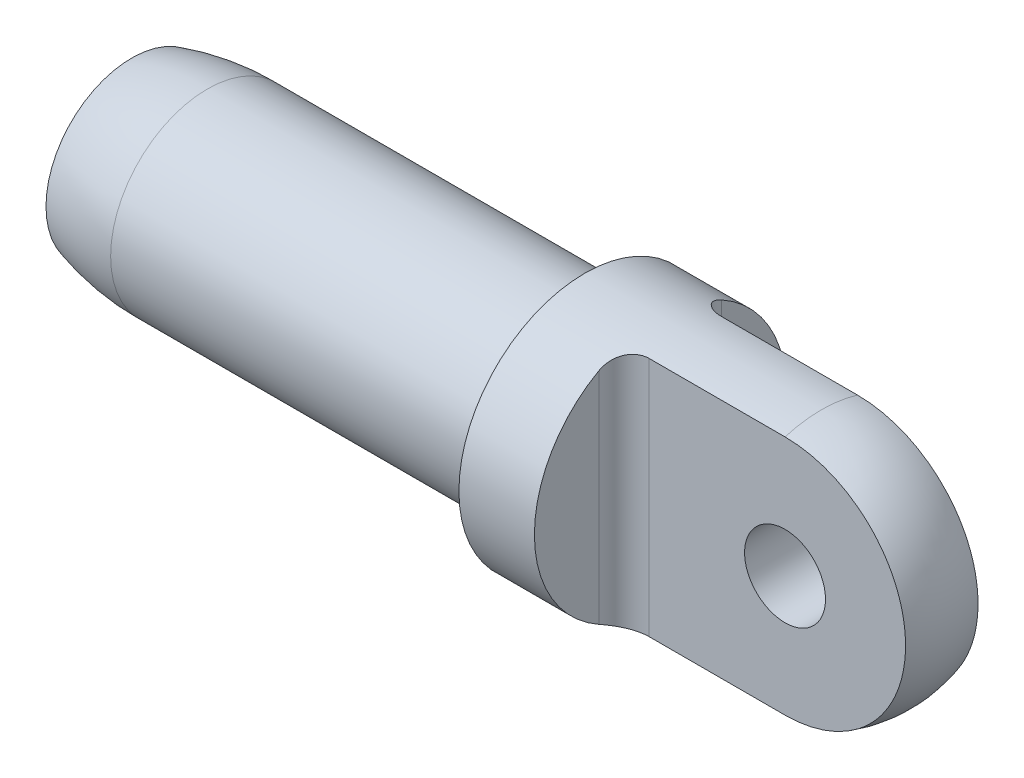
ISO-10303-21;
HEADER;
FILE_DESCRIPTION(('STEP AP214'),'2;1');
FILE_NAME('part.step','',(''),(''),'','','');
FILE_SCHEMA(('AUTOMOTIVE_DESIGN { 1 0 10303 214 1 1 1 1 }'));
ENDSEC;
DATA;
#1=APPLICATION_CONTEXT('core data for automotive mechanical design processes');
#2=APPLICATION_PROTOCOL_DEFINITION('international standard','automotive_design',2000,#1);
#3=PRODUCT_CONTEXT('',#1,'mechanical');
#4=PRODUCT('Part','Part','',(#3));
#5=PRODUCT_RELATED_PRODUCT_CATEGORY('part','',(#4));
#6=PRODUCT_DEFINITION_FORMATION('','',#4);
#7=PRODUCT_DEFINITION_CONTEXT('part definition',#1,'design');
#8=PRODUCT_DEFINITION('design','',#6,#7);
#9=PRODUCT_DEFINITION_SHAPE('','',#8);
#10=(LENGTH_UNIT() NAMED_UNIT(*) SI_UNIT(.MILLI.,.METRE.));
#11=(NAMED_UNIT(*) PLANE_ANGLE_UNIT() SI_UNIT($,.RADIAN.));
#12=(NAMED_UNIT(*) SI_UNIT($,.STERADIAN.) SOLID_ANGLE_UNIT());
#13=UNCERTAINTY_MEASURE_WITH_UNIT(LENGTH_MEASURE(1.E-05),#10,'distance_accuracy_value','');
#14=(GEOMETRIC_REPRESENTATION_CONTEXT(3) GLOBAL_UNCERTAINTY_ASSIGNED_CONTEXT((#13)) GLOBAL_UNIT_ASSIGNED_CONTEXT((#10,
#11,#12)) REPRESENTATION_CONTEXT('',''));
#15=CARTESIAN_POINT('',(0.,0.,0.));
#16=DIRECTION('',(0.,0.,1.));
#17=DIRECTION('',(1.,0.,0.));
#18=AXIS2_PLACEMENT_3D('',#15,#16,#17);
#19=CARTESIAN_POINT('',(-57.15,0.,0.));
#20=DIRECTION('',(-1.,0.,0.));
#21=DIRECTION('',(0.,0.,1.));
#22=AXIS2_PLACEMENT_3D('',#19,#20,#21);
#23=CYLINDRICAL_SURFACE('',#22,7.9375);
#24=CARTESIAN_POINT('',(-13.6525,0.,0.));
#25=DIRECTION('',(-1.,0.,0.));
#26=DIRECTION('',(0.,0.,1.));
#27=AXIS2_PLACEMENT_3D('',#24,#25,#26);
#28=CIRCLE('',#27,7.93749999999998);
#29=CARTESIAN_POINT('',(-13.6525,-7.60119137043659,-2.286));
#30=VERTEX_POINT('',#29);
#31=CARTESIAN_POINT('',(-13.6525,-7.60119137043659,2.286));
#32=VERTEX_POINT('',#31);
#33=EDGE_CURVE('E90',#30,#32,#28,.T.);
#34=ORIENTED_EDGE('',*,*,#33,.T.);
#35=DIRECTION('',(-1.,0.,0.));
#36=VECTOR('',#35,1.);
#37=CARTESIAN_POINT('',(-57.15,-7.60119137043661,2.28599999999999));
#38=LINE('',#37,#36);
#39=CARTESIAN_POINT('',(-22.225,-7.60119137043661,2.286));
#40=VERTEX_POINT('',#39);
#41=EDGE_CURVE('E33',#32,#40,#38,.T.);
#42=ORIENTED_EDGE('',*,*,#41,.T.);
#43=CARTESIAN_POINT('',(-22.225,-5.76032857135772,5.46099999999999));
#44=CARTESIAN_POINT('',(-22.151545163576,-5.76032942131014,5.46099932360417));
#45=CARTESIAN_POINT('',(-22.0780860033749,-5.76521273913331,5.45586188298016));
#46=CARTESIAN_POINT('',(-21.9337456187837,-5.78417009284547,5.43575788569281));
#47=CARTESIAN_POINT('',(-21.8628664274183,-5.7982512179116,5.4207837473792));
#48=CARTESIAN_POINT('',(-21.7261938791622,-5.83402519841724,5.3822607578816));
#49=CARTESIAN_POINT('',(-21.6603661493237,-5.85565975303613,5.35877753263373));
#50=CARTESIAN_POINT('',(-21.5342269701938,-5.90488821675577,5.30448352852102));
#51=CARTESIAN_POINT('',(-21.4739193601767,-5.93248622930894,5.27366770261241));
#52=CARTESIAN_POINT('',(-21.3350653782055,-6.00468447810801,5.19150922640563));
#53=CARTESIAN_POINT('',(-21.259569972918,-6.05154336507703,5.13699338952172));
#54=CARTESIAN_POINT('',(-21.1210289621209,-6.15061608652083,5.01795268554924));
#55=CARTESIAN_POINT('',(-21.0580025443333,-6.20283798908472,4.95341266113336));
#56=CARTESIAN_POINT('',(-20.943498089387,-6.31102593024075,4.81484395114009));
#57=CARTESIAN_POINT('',(-20.8922554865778,-6.36704339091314,4.74066170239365));
#58=CARTESIAN_POINT('',(-20.8031699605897,-6.47986686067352,4.58524425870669));
#59=CARTESIAN_POINT('',(-20.7653263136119,-6.53667282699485,4.50400944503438));
#60=CARTESIAN_POINT('',(-20.6985106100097,-6.65886587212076,4.32172899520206));
#61=CARTESIAN_POINT('',(-20.6720708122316,-6.7241040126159,4.21963890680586));
#62=CARTESIAN_POINT('',(-20.6398396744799,-6.85114269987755,4.01008172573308));
#63=CARTESIAN_POINT('',(-20.6340540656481,-6.91294228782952,3.90261314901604));
#64=CARTESIAN_POINT('',(-20.644729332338,-7.02897838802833,3.68938863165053));
#65=CARTESIAN_POINT('',(-20.6604370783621,-7.08340113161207,3.58369957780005));
#66=CARTESIAN_POINT('',(-20.7140715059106,-7.1853433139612,3.37464483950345));
#67=CARTESIAN_POINT('',(-20.7519727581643,-7.23287057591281,3.27127663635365));
#68=CARTESIAN_POINT('',(-20.8438669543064,-7.31414852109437,3.08482614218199));
#69=CARTESIAN_POINT('',(-20.8951642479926,-7.34888483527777,3.00084444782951));
#70=CARTESIAN_POINT('',(-21.0139481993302,-7.41163094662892,2.84233952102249));
#71=CARTESIAN_POINT('',(-21.0814228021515,-7.43964572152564,2.76780930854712));
#72=CARTESIAN_POINT('',(-21.2223501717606,-7.48608336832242,2.63943521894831));
#73=CARTESIAN_POINT('',(-21.2943184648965,-7.50522407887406,2.58421553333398));
#74=CARTESIAN_POINT('',(-21.4474959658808,-7.53817653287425,2.48645730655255));
#75=CARTESIAN_POINT('',(-21.5287019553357,-7.55199012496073,2.44391436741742));
#76=CARTESIAN_POINT('',(-21.6932487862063,-7.573875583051,2.37519496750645));
#77=CARTESIAN_POINT('',(-21.7762376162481,-7.58221719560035,2.3482588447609));
#78=CARTESIAN_POINT('',(-21.9458156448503,-7.59447289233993,2.30831747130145));
#79=CARTESIAN_POINT('',(-22.0324043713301,-7.59838755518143,2.29531039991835));
#80=CARTESIAN_POINT('',(-22.2050561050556,-7.60185163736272,2.28381107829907));
#81=CARTESIAN_POINT('',(-22.2911006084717,-7.60147821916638,2.28506225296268));
#82=CARTESIAN_POINT('',(-22.461738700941,-7.59654352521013,2.30141352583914));
#83=CARTESIAN_POINT('',(-22.5463323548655,-7.59198243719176,2.31651300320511));
#84=CARTESIAN_POINT('',(-22.7114547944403,-7.57858703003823,2.35996505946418));
#85=CARTESIAN_POINT('',(-22.7919933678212,-7.56976360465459,2.38828384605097));
#86=CARTESIAN_POINT('',(-22.9470010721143,-7.54769152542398,2.45714445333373));
#87=CARTESIAN_POINT('',(-23.0214703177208,-7.53444295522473,2.49768604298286));
#88=CARTESIAN_POINT('',(-23.1629641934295,-7.50323849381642,2.58992259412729));
#89=CARTESIAN_POINT('',(-23.229920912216,-7.48524393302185,2.64170853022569));
#90=CARTESIAN_POINT('',(-23.3540254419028,-7.44452878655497,2.75435592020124));
#91=CARTESIAN_POINT('',(-23.4111726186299,-7.42180789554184,2.81521796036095));
#92=CARTESIAN_POINT('',(-23.5159966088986,-7.37098435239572,2.94576510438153));
#93=CARTESIAN_POINT('',(-23.5633528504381,-7.34274541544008,3.01565400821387));
#94=CARTESIAN_POINT('',(-23.6457867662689,-7.28160406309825,3.16043110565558));
#95=CARTESIAN_POINT('',(-23.6808614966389,-7.24870053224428,3.235320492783));
#96=CARTESIAN_POINT('',(-23.7404762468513,-7.17638746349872,3.39283838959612));
#97=CARTESIAN_POINT('',(-23.7641766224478,-7.13669307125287,3.47565263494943));
#98=CARTESIAN_POINT('',(-23.7978250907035,-7.0532526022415,3.64200616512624));
#99=CARTESIAN_POINT('',(-23.8077679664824,-7.00950499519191,3.72554571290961));
#100=CARTESIAN_POINT('',(-23.8149328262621,-6.91392656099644,3.90031683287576));
#101=CARTESIAN_POINT('',(-23.8106717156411,-6.86173240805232,3.99140941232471));
#102=CARTESIAN_POINT('',(-23.7871632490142,-6.75467428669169,4.17003002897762));
#103=CARTESIAN_POINT('',(-23.7679061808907,-6.69980860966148,4.25755571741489));
#104=CARTESIAN_POINT('',(-23.7121417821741,-6.58194394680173,4.43789291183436));
#105=CARTESIAN_POINT('',(-23.6738030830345,-6.51877502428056,4.53002919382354));
#106=CARTESIAN_POINT('',(-23.5804268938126,-6.3929708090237,4.70590305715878));
#107=CARTESIAN_POINT('',(-23.5253829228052,-6.33033573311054,4.78963736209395));
#108=CARTESIAN_POINT('',(-23.4062410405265,-6.21525742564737,4.93784122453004));
#109=CARTESIAN_POINT('',(-23.3438630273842,-6.16246119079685,5.00341839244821));
#110=CARTESIAN_POINT('',(-23.2064808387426,-6.06206977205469,5.12458574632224));
#111=CARTESIAN_POINT('',(-23.1314956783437,-6.01446693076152,5.18019071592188));
#112=CARTESIAN_POINT('',(-22.9891928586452,-5.93861553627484,5.26680369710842));
#113=CARTESIAN_POINT('',(-22.9245194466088,-5.9084855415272,5.30049826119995));
#114=CARTESIAN_POINT('',(-22.7887373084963,-5.85513686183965,5.35937101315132));
#115=CARTESIAN_POINT('',(-22.7176363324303,-5.83190999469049,5.38455928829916));
#116=CARTESIAN_POINT('',(-22.5770937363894,-5.79615946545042,5.42301352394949));
#117=CARTESIAN_POINT('',(-22.5080989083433,-5.78284902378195,5.43716164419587));
#118=CARTESIAN_POINT('',(-22.3677362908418,-5.76493619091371,5.45615197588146));
#119=CARTESIAN_POINT('',(-22.2963701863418,-5.76032774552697,5.46100065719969));
#120=CARTESIAN_POINT('',(-22.225,-5.76032857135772,5.46099999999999));
#121=B_SPLINE_CURVE_WITH_KNOTS('',3,(#43,#44,#45,#46,#47,#48,#49,#50,#51,#52,#53,#54,#55,#56,
#57,#58,#59,#60,#61,#62,#63,#64,#65,#66,#67,#68,#69,#70,#71,#72,#73,#74,#75,#76,#77,#78,#79,#80,
#81,#82,#83,#84,#85,#86,#87,#88,#89,#90,#91,#92,#93,#94,#95,#96,#97,#98,#99,#100,#101,#102,#103,
#104,#105,#106,#107,#108,#109,#110,#111,#112,#113,#114,#115,#116,#117,#118,#119,#120),
.UNSPECIFIED.,.T.,.F.,(4,2,2,2,2,2,2,2,2,2,2,2,2,2,2,2,2,2,2,2,2,2,2,2,2,2,2,2,2,2,2,2,2,2,2,2,
2,2,4),(0.,0.220051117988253,0.44027204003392,0.65882946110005,0.877537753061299,
1.1885938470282,1.50012494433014,1.81742427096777,2.13470645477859,2.5049051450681,
2.87520655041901,3.23285946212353,3.59010337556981,3.9014133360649,4.21249203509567,
4.48919646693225,4.76580478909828,5.02747796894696,5.28911694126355,5.54605530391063,
5.802982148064,6.05925578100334,6.3155245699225,6.57394961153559,6.83239135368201,
7.09828483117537,7.36424200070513,7.64760426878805,7.93107395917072,8.24502992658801,
8.55918939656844,8.91201374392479,9.26497514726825,9.57815139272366,9.89085945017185,
10.1267200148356,10.3622998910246,10.5762548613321,10.7900609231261),.UNSPECIFIED.);
#122=CARTESIAN_POINT('',(-23.8125,-6.92819630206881,3.87350000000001));
#123=VERTEX_POINT('',#122);
#124=EDGE_CURVE('E10',#40,#123,#121,.T.);
#125=ORIENTED_EDGE('',*,*,#124,.T.);
#126=CARTESIAN_POINT('',(-23.8125,0.,0.));
#127=DIRECTION('',(-1.,0.,0.));
#128=DIRECTION('',(0.,0.,1.));
#129=AXIS2_PLACEMENT_3D('',#126,#127,#128);
#130=CIRCLE('',#129,7.9375);
#131=CARTESIAN_POINT('',(-23.8125,6.92819630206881,3.87350000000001));
#132=VERTEX_POINT('',#131);
#133=EDGE_CURVE('E331',#123,#132,#130,.T.);
#134=ORIENTED_EDGE('',*,*,#133,.T.);
#135=CARTESIAN_POINT('',(-22.225,5.76032857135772,5.46099999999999));
#136=CARTESIAN_POINT('',(-22.298454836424,5.76032942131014,5.46099932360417));
#137=CARTESIAN_POINT('',(-22.3719139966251,5.7652127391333,5.45586188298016));
#138=CARTESIAN_POINT('',(-22.5162543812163,5.78417009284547,5.43575788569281));
#139=CARTESIAN_POINT('',(-22.5871335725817,5.7982512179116,5.4207837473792));
#140=CARTESIAN_POINT('',(-22.7238061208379,5.83402519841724,5.3822607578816));
#141=CARTESIAN_POINT('',(-22.7896338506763,5.85565975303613,5.35877753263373));
#142=CARTESIAN_POINT('',(-22.9157730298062,5.90488821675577,5.30448352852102));
#143=CARTESIAN_POINT('',(-22.9760806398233,5.93248622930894,5.27366770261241));
#144=CARTESIAN_POINT('',(-23.1149346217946,6.00468447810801,5.19150922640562));
#145=CARTESIAN_POINT('',(-23.190430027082,6.05154336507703,5.13699338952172));
#146=CARTESIAN_POINT('',(-23.3289710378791,6.15061608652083,5.01795268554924));
#147=CARTESIAN_POINT('',(-23.3919974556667,6.20283798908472,4.95341266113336));
#148=CARTESIAN_POINT('',(-23.506501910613,6.31102593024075,4.81484395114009));
#149=CARTESIAN_POINT('',(-23.5577445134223,6.36704339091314,4.74066170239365));
#150=CARTESIAN_POINT('',(-23.6468300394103,6.47986686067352,4.58524425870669));
#151=CARTESIAN_POINT('',(-23.6846736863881,6.53667282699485,4.50400944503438));
#152=CARTESIAN_POINT('',(-23.7514893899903,6.65886587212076,4.32172899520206));
#153=CARTESIAN_POINT('',(-23.7779291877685,6.7241040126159,4.21963890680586));
#154=CARTESIAN_POINT('',(-23.8101603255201,6.85114269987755,4.01008172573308));
#155=CARTESIAN_POINT('',(-23.8159459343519,6.91294228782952,3.90261314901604));
#156=CARTESIAN_POINT('',(-23.8052706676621,7.02897838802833,3.68938863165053));
#157=CARTESIAN_POINT('',(-23.789562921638,7.08340113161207,3.58369957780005));
#158=CARTESIAN_POINT('',(-23.7359284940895,7.1853433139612,3.37464483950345));
#159=CARTESIAN_POINT('',(-23.6980272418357,7.23287057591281,3.27127663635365));
#160=CARTESIAN_POINT('',(-23.6061330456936,7.31414852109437,3.08482614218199));
#161=CARTESIAN_POINT('',(-23.5548357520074,7.34888483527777,3.00084444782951));
#162=CARTESIAN_POINT('',(-23.4360518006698,7.41163094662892,2.84233952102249));
#163=CARTESIAN_POINT('',(-23.3685771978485,7.43964572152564,2.76780930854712));
#164=CARTESIAN_POINT('',(-23.2276498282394,7.48608336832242,2.63943521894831));
#165=CARTESIAN_POINT('',(-23.1556815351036,7.50522407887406,2.58421553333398));
#166=CARTESIAN_POINT('',(-23.0025040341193,7.53817653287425,2.48645730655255));
#167=CARTESIAN_POINT('',(-22.9212980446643,7.55199012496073,2.44391436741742));
#168=CARTESIAN_POINT('',(-22.7567512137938,7.573875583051,2.37519496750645));
#169=CARTESIAN_POINT('',(-22.673762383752,7.58221719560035,2.3482588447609));
#170=CARTESIAN_POINT('',(-22.5041843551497,7.59447289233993,2.30831747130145));
#171=CARTESIAN_POINT('',(-22.4175956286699,7.59838755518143,2.29531039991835));
#172=CARTESIAN_POINT('',(-22.2449438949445,7.60185163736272,2.28381107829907));
#173=CARTESIAN_POINT('',(-22.1588993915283,7.60147821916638,2.28506225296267));
#174=CARTESIAN_POINT('',(-21.988261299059,7.59654352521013,2.30141352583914));
#175=CARTESIAN_POINT('',(-21.9036676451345,7.59198243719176,2.31651300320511));
#176=CARTESIAN_POINT('',(-21.7385452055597,7.57858703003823,2.35996505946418));
#177=CARTESIAN_POINT('',(-21.6580066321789,7.56976360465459,2.38828384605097));
#178=CARTESIAN_POINT('',(-21.5029989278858,7.54769152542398,2.45714445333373));
#179=CARTESIAN_POINT('',(-21.4285296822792,7.53444295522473,2.49768604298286));
#180=CARTESIAN_POINT('',(-21.2870358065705,7.50323849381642,2.58992259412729));
#181=CARTESIAN_POINT('',(-21.220079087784,7.48524393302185,2.64170853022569));
#182=CARTESIAN_POINT('',(-21.0959745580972,7.44452878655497,2.75435592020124));
#183=CARTESIAN_POINT('',(-21.0388273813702,7.42180789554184,2.81521796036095));
#184=CARTESIAN_POINT('',(-20.9340033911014,7.37098435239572,2.94576510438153));
#185=CARTESIAN_POINT('',(-20.886647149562,7.34274541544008,3.01565400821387));
#186=CARTESIAN_POINT('',(-20.8042132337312,7.28160406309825,3.16043110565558));
#187=CARTESIAN_POINT('',(-20.7691385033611,7.24870053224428,3.235320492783));
#188=CARTESIAN_POINT('',(-20.7095237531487,7.17638746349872,3.39283838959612));
#189=CARTESIAN_POINT('',(-20.6858233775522,7.13669307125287,3.47565263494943));
#190=CARTESIAN_POINT('',(-20.6521749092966,7.0532526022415,3.64200616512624));
#191=CARTESIAN_POINT('',(-20.6422320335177,7.00950499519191,3.72554571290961));
#192=CARTESIAN_POINT('',(-20.635067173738,6.91392656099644,3.90031683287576));
#193=CARTESIAN_POINT('',(-20.6393282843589,6.86173240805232,3.99140941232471));
#194=CARTESIAN_POINT('',(-20.6628367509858,6.75467428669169,4.17003002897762));
#195=CARTESIAN_POINT('',(-20.6820938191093,6.69980860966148,4.25755571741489));
#196=CARTESIAN_POINT('',(-20.7378582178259,6.58194394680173,4.43789291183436));
#197=CARTESIAN_POINT('',(-20.7761969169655,6.51877502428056,4.53002919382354));
#198=CARTESIAN_POINT('',(-20.8695731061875,6.3929708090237,4.70590305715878));
#199=CARTESIAN_POINT('',(-20.9246170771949,6.33033573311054,4.78963736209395));
#200=CARTESIAN_POINT('',(-21.0437589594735,6.21525742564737,4.93784122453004));
#201=CARTESIAN_POINT('',(-21.1061369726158,6.16246119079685,5.00341839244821));
#202=CARTESIAN_POINT('',(-21.2435191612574,6.06206977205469,5.12458574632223));
#203=CARTESIAN_POINT('',(-21.3185043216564,6.01446693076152,5.18019071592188));
#204=CARTESIAN_POINT('',(-21.4608071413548,5.93861553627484,5.26680369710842));
#205=CARTESIAN_POINT('',(-21.5254805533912,5.9084855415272,5.30049826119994));
#206=CARTESIAN_POINT('',(-21.6612626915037,5.85513686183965,5.35937101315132));
#207=CARTESIAN_POINT('',(-21.7323636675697,5.83190999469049,5.38455928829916));
#208=CARTESIAN_POINT('',(-21.8729062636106,5.79615946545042,5.42301352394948));
#209=CARTESIAN_POINT('',(-21.9419010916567,5.78284902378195,5.43716164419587));
#210=CARTESIAN_POINT('',(-22.0822637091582,5.76493619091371,5.45615197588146));
#211=CARTESIAN_POINT('',(-22.1536298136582,5.76032774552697,5.46100065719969));
#212=CARTESIAN_POINT('',(-22.225,5.76032857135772,5.46099999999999));
#213=B_SPLINE_CURVE_WITH_KNOTS('',3,(#135,#136,#137,#138,#139,#140,#141,#142,#143,#144,#145,
#146,#147,#148,#149,#150,#151,#152,#153,#154,#155,#156,#157,#158,#159,#160,#161,#162,#163,#164,
#165,#166,#167,#168,#169,#170,#171,#172,#173,#174,#175,#176,#177,#178,#179,#180,#181,#182,#183,
#184,#185,#186,#187,#188,#189,#190,#191,#192,#193,#194,#195,#196,#197,#198,#199,#200,#201,#202,
#203,#204,#205,#206,#207,#208,#209,#210,#211,#212),.UNSPECIFIED.,.T.,.F.,(4,2,2,2,2,2,2,2,2,2,2,
2,2,2,2,2,2,2,2,2,2,2,2,2,2,2,2,2,2,2,2,2,2,2,2,2,2,2,4),(0.,0.220051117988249,0.44027204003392,
0.65882946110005,0.877537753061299,1.1885938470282,1.50012494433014,1.81742427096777,
2.13470645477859,2.5049051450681,2.87520655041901,3.23285946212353,3.59010337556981,
3.9014133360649,4.21249203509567,4.48919646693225,4.76580478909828,5.02747796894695,
5.28911694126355,5.54605530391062,5.802982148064,6.05925578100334,6.3155245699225,
6.57394961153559,6.83239135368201,7.09828483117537,7.36424200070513,7.64760426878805,
7.93107395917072,8.24502992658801,8.55918939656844,8.91201374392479,9.26497514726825,
9.57815139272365,9.89085945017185,10.1267200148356,10.3622998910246,10.5762548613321,
10.7900609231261),.UNSPECIFIED.);
#214=CARTESIAN_POINT('',(-22.225,7.60119137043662,2.286));
#215=VERTEX_POINT('',#214);
#216=EDGE_CURVE('E26',#132,#215,#213,.T.);
#217=ORIENTED_EDGE('',*,*,#216,.T.);
#218=DIRECTION('',(-1.,0.,0.));
#219=VECTOR('',#218,1.);
#220=CARTESIAN_POINT('',(-57.15,7.60119137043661,2.28599999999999));
#221=LINE('',#220,#219);
#222=CARTESIAN_POINT('',(-13.6525,7.60119137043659,2.286));
#223=VERTEX_POINT('',#222);
#224=EDGE_CURVE('E84',#215,#223,#221,.F.);
#225=ORIENTED_EDGE('',*,*,#224,.T.);
#226=CARTESIAN_POINT('',(-13.6525,7.60119137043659,-2.286));
#227=VERTEX_POINT('',#226);
#228=EDGE_CURVE('E41',#223,#227,#28,.T.);
#229=ORIENTED_EDGE('',*,*,#228,.T.);
#230=DIRECTION('',(-1.,0.,0.));
#231=VECTOR('',#230,1.);
#232=CARTESIAN_POINT('',(-57.15,7.60119137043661,-2.286));
#233=LINE('',#232,#231);
#234=CARTESIAN_POINT('',(-22.225,7.60119137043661,-2.286));
#235=VERTEX_POINT('',#234);
#236=EDGE_CURVE('E103',#227,#235,#233,.T.);
#237=ORIENTED_EDGE('',*,*,#236,.T.);
#238=CARTESIAN_POINT('',(-22.225,7.60119137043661,-2.286));
#239=CARTESIAN_POINT('',(-22.3108637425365,7.60119146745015,-2.28600136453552));
#240=CARTESIAN_POINT('',(-22.3967431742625,7.59910012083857,-2.29298898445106));
#241=CARTESIAN_POINT('',(-22.5660612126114,7.59068350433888,-2.32069700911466));
#242=CARTESIAN_POINT('',(-22.6494990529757,7.58435691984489,-2.34142167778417));
#243=CARTESIAN_POINT('',(-22.8115105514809,7.56733980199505,-2.39584667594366));
#244=CARTESIAN_POINT('',(-22.8900865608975,7.55665139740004,-2.42954067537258));
#245=CARTESIAN_POINT('',(-23.0402453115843,7.53074744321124,-2.50867977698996));
#246=CARTESIAN_POINT('',(-23.1118286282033,7.51553226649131,-2.55412391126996));
#247=CARTESIAN_POINT('',(-23.2467289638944,7.48029857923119,-2.65554808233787));
#248=CARTESIAN_POINT('',(-23.3099714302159,7.46024076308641,-2.71161348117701));
#249=CARTESIAN_POINT('',(-23.4260198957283,7.41537233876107,-2.83200986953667));
#250=CARTESIAN_POINT('',(-23.4788249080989,7.39056128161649,-2.8963416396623));
#251=CARTESIAN_POINT('',(-23.5747169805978,7.3353703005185,-3.03346188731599));
#252=CARTESIAN_POINT('',(-23.6173958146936,7.3048248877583,-3.10646854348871));
#253=CARTESIAN_POINT('',(-23.6901044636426,7.23915041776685,-3.25658161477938));
#254=CARTESIAN_POINT('',(-23.7201306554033,7.20402005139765,-3.33368919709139));
#255=CARTESIAN_POINT('',(-23.7693581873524,7.12693591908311,-3.49561282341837));
#256=CARTESIAN_POINT('',(-23.7875843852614,7.08466858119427,-3.58057467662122));
#257=CARTESIAN_POINT('',(-23.8100314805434,6.99629491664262,-3.75032513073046));
#258=CARTESIAN_POINT('',(-23.8142470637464,6.95018714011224,-3.83511365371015));
#259=CARTESIAN_POINT('',(-23.8091809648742,6.84962204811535,-4.01224323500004));
#260=CARTESIAN_POINT('',(-23.7982994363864,6.79481306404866,-4.10433816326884));
#261=CARTESIAN_POINT('',(-23.7612454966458,6.68297888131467,-4.28403172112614));
#262=CARTESIAN_POINT('',(-23.735060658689,6.62595191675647,-4.3716266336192));
#263=CARTESIAN_POINT('',(-23.6643928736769,6.50444419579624,-4.55073101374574));
#264=CARTESIAN_POINT('',(-23.6181116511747,6.43987977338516,-4.64147760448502));
#265=CARTESIAN_POINT('',(-23.508430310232,6.31243201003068,-4.81337137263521));
#266=CARTESIAN_POINT('',(-23.4450313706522,6.24954855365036,-4.89451921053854));
#267=CARTESIAN_POINT('',(-23.3150401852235,6.14021517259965,-5.03068612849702));
#268=CARTESIAN_POINT('',(-23.251309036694,6.09290365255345,-5.08774604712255));
#269=CARTESIAN_POINT('',(-23.1129189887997,6.00404393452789,-5.19230668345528));
#270=CARTESIAN_POINT('',(-23.0382784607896,5.96248627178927,-5.23982315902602));
#271=CARTESIAN_POINT('',(-22.8968317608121,5.89681284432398,-5.31350815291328));
#272=CARTESIAN_POINT('',(-22.8321256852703,5.87088102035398,-5.34207383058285));
#273=CARTESIAN_POINT('',(-22.6972752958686,5.82616010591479,-5.39081272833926));
#274=CARTESIAN_POINT('',(-22.6271356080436,5.80736501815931,-5.41099299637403));
#275=CARTESIAN_POINT('',(-22.4823399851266,5.77854554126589,-5.44176249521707));
#276=CARTESIAN_POINT('',(-22.4076512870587,5.76859554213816,-5.45227040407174));
#277=CARTESIAN_POINT('',(-22.2568935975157,5.75893719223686,-5.46247256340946));
#278=CARTESIAN_POINT('',(-22.1808255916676,5.75922179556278,-5.46217425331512));
#279=CARTESIAN_POINT('',(-22.0399599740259,5.7692706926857,-5.45155522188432));
#280=CARTESIAN_POINT('',(-21.9749683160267,5.77781429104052,-5.44252503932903));
#281=CARTESIAN_POINT('',(-21.8478334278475,5.80183645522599,-5.41690927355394));
#282=CARTESIAN_POINT('',(-21.7856915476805,5.8173182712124,-5.40032014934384));
#283=CARTESIAN_POINT('',(-21.6482952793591,5.85930367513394,-5.35478002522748));
#284=CARTESIAN_POINT('',(-21.5743404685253,5.88768988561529,-5.3236547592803));
#285=CARTESIAN_POINT('',(-21.4342388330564,5.95144041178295,-5.25229053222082));
#286=CARTESIAN_POINT('',(-21.3681072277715,5.98681798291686,-5.21203423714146));
#287=CARTESIAN_POINT('',(-21.2253323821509,6.07375231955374,-5.11068652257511));
#288=CARTESIAN_POINT('',(-21.1515623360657,6.12696575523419,-5.04697636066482));
#289=CARTESIAN_POINT('',(-21.018239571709,6.23775401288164,-4.90939497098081));
#290=CARTESIAN_POINT('',(-20.9586979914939,6.29533220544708,-4.83551585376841));
#291=CARTESIAN_POINT('',(-20.8532218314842,6.41314964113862,-4.67816463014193));
#292=CARTESIAN_POINT('',(-20.8075176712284,6.47341658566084,-4.59455913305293));
#293=CARTESIAN_POINT('',(-20.7316354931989,6.59360385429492,-4.42035084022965));
#294=CARTESIAN_POINT('',(-20.7014583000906,6.65352415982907,-4.32974767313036));
#295=CARTESIAN_POINT('',(-20.6553223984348,6.77750747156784,-4.1332982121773));
#296=CARTESIAN_POINT('',(-20.6412169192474,6.84133342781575,-4.02685551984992));
#297=CARTESIAN_POINT('',(-20.6350692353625,6.96414983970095,-3.8105073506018));
#298=CARTESIAN_POINT('',(-20.6430219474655,7.02314140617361,-3.70060267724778));
#299=CARTESIAN_POINT('',(-20.6811158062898,7.13003135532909,-3.48990574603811));
#300=CARTESIAN_POINT('',(-20.7095145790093,7.178432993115,-3.38905905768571));
#301=CARTESIAN_POINT('',(-20.7871860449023,7.26805230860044,-3.19233042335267));
#302=CARTESIAN_POINT('',(-20.8364348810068,7.30927812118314,-3.09644294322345));
#303=CARTESIAN_POINT('',(-20.9472833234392,7.37873855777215,-2.92667482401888));
#304=CARTESIAN_POINT('',(-21.0063769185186,7.40797114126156,-2.85156236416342));
#305=CARTESIAN_POINT('',(-21.1384598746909,7.46014883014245,-2.71212647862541));
#306=CARTESIAN_POINT('',(-21.2114420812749,7.4830971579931,-2.64779752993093));
#307=CARTESIAN_POINT('',(-21.3617128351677,7.52089946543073,-2.53831261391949));
#308=CARTESIAN_POINT('',(-21.4379734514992,7.53630692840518,-2.49193146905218));
#309=CARTESIAN_POINT('',(-21.5978563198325,7.56214096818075,-2.41240295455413));
#310=CARTESIAN_POINT('',(-21.6814739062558,7.57257067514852,-2.37924727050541));
#311=CARTESIAN_POINT('',(-21.8413593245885,7.58751142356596,-2.33111908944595));
#312=CARTESIAN_POINT('',(-21.9170029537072,7.59264929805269,-2.31424295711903));
#313=CARTESIAN_POINT('',(-22.0700935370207,7.59948912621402,-2.29168312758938));
#314=CARTESIAN_POINT('',(-22.1475403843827,7.60119128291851,-2.28599876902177));
#315=CARTESIAN_POINT('',(-22.225,7.60119137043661,-2.286));
#316=B_SPLINE_CURVE_WITH_KNOTS('',3,(#238,#239,#240,#241,#242,#243,#244,#245,#246,#247,#248,
#249,#250,#251,#252,#253,#254,#255,#256,#257,#258,#259,#260,#261,#262,#263,#264,#265,#266,#267,
#268,#269,#270,#271,#272,#273,#274,#275,#276,#277,#278,#279,#280,#281,#282,#283,#284,#285,#286,
#287,#288,#289,#290,#291,#292,#293,#294,#295,#296,#297,#298,#299,#300,#301,#302,#303,#304,#305,
#306,#307,#308,#309,#310,#311,#312,#313,#314,#315),.UNSPECIFIED.,.T.,.F.,(4,2,2,2,2,2,2,2,2,2,2,
2,2,2,2,2,2,2,2,2,2,2,2,2,2,2,2,2,2,2,2,2,2,2,2,2,2,2,4),(0.,0.257311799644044,
0.514703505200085,0.771969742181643,1.02921479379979,1.28862246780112,1.54805465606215,
1.81663288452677,2.08528796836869,2.37399363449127,2.6628087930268,2.9846761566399,
3.30680524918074,3.66704389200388,4.02725773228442,4.31948553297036,4.61122677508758,
4.83638184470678,5.06134728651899,5.28818733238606,5.51487121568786,5.71247710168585,
5.91017565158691,6.16412216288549,6.41855485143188,6.74996643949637,7.08163661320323,
7.41855927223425,7.75549982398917,8.1282704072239,8.50095509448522,8.84515460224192,
9.18896132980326,9.48714724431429,9.78517996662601,10.0555587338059,10.3257672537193,
10.557907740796,10.7900345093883),.UNSPECIFIED.);
#317=CARTESIAN_POINT('',(-23.8125,6.92819630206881,-3.87350000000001));
#318=VERTEX_POINT('',#317);
#319=EDGE_CURVE('E129',#235,#318,#316,.T.);
#320=ORIENTED_EDGE('',*,*,#319,.T.);
#321=CARTESIAN_POINT('',(-23.8125,0.,0.));
#322=DIRECTION('',(-1.,0.,0.));
#323=DIRECTION('',(0.,0.,1.));
#324=AXIS2_PLACEMENT_3D('',#321,#322,#323);
#325=CIRCLE('',#324,7.9375);
#326=CARTESIAN_POINT('',(-23.8125,-6.92819630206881,-3.87350000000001));
#327=VERTEX_POINT('',#326);
#328=EDGE_CURVE('E126',#318,#327,#325,.T.);
#329=ORIENTED_EDGE('',*,*,#328,.T.);
#330=CARTESIAN_POINT('',(-22.225,-7.60119137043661,-2.286));
#331=CARTESIAN_POINT('',(-22.1391362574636,-7.60119146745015,-2.28600136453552));
#332=CARTESIAN_POINT('',(-22.0532568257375,-7.59910012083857,-2.29298898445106));
#333=CARTESIAN_POINT('',(-21.8839387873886,-7.59068350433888,-2.32069700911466));
#334=CARTESIAN_POINT('',(-21.8005009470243,-7.58435691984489,-2.34142167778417));
#335=CARTESIAN_POINT('',(-21.6384894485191,-7.56733980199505,-2.39584667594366));
#336=CARTESIAN_POINT('',(-21.5599134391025,-7.55665139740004,-2.42954067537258));
#337=CARTESIAN_POINT('',(-21.4097546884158,-7.53074744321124,-2.50867977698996));
#338=CARTESIAN_POINT('',(-21.3381713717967,-7.51553226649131,-2.55412391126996));
#339=CARTESIAN_POINT('',(-21.2032710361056,-7.48029857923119,-2.65554808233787));
#340=CARTESIAN_POINT('',(-21.1400285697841,-7.46024076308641,-2.71161348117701));
#341=CARTESIAN_POINT('',(-21.0239801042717,-7.41537233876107,-2.83200986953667));
#342=CARTESIAN_POINT('',(-20.9711750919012,-7.39056128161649,-2.8963416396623));
#343=CARTESIAN_POINT('',(-20.8752830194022,-7.3353703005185,-3.03346188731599));
#344=CARTESIAN_POINT('',(-20.8326041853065,-7.3048248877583,-3.10646854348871));
#345=CARTESIAN_POINT('',(-20.7598955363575,-7.23915041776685,-3.25658161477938));
#346=CARTESIAN_POINT('',(-20.7298693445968,-7.20402005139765,-3.33368919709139));
#347=CARTESIAN_POINT('',(-20.6806418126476,-7.12693591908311,-3.49561282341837));
#348=CARTESIAN_POINT('',(-20.6624156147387,-7.08466858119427,-3.58057467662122));
#349=CARTESIAN_POINT('',(-20.6399685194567,-6.99629491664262,-3.75032513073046));
#350=CARTESIAN_POINT('',(-20.6357529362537,-6.95018714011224,-3.83511365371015));
#351=CARTESIAN_POINT('',(-20.6408190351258,-6.84962204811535,-4.01224323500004));
#352=CARTESIAN_POINT('',(-20.6517005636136,-6.79481306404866,-4.10433816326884));
#353=CARTESIAN_POINT('',(-20.6887545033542,-6.68297888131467,-4.28403172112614));
#354=CARTESIAN_POINT('',(-20.7149393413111,-6.62595191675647,-4.3716266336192));
#355=CARTESIAN_POINT('',(-20.7856071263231,-6.50444419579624,-4.55073101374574));
#356=CARTESIAN_POINT('',(-20.8318883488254,-6.43987977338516,-4.64147760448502));
#357=CARTESIAN_POINT('',(-20.9415696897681,-6.31243201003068,-4.81337137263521));
#358=CARTESIAN_POINT('',(-21.0049686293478,-6.24954855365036,-4.89451921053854));
#359=CARTESIAN_POINT('',(-21.1349598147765,-6.14021517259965,-5.03068612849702));
#360=CARTESIAN_POINT('',(-21.198690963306,-6.09290365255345,-5.08774604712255));
#361=CARTESIAN_POINT('',(-21.3370810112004,-6.00404393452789,-5.19230668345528));
#362=CARTESIAN_POINT('',(-21.4117215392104,-5.96248627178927,-5.23982315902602));
#363=CARTESIAN_POINT('',(-21.553168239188,-5.89681284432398,-5.31350815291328));
#364=CARTESIAN_POINT('',(-21.6178743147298,-5.87088102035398,-5.34207383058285));
#365=CARTESIAN_POINT('',(-21.7527247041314,-5.82616010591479,-5.39081272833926));
#366=CARTESIAN_POINT('',(-21.8228643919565,-5.80736501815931,-5.41099299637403));
#367=CARTESIAN_POINT('',(-21.9676600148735,-5.77854554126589,-5.44176249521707));
#368=CARTESIAN_POINT('',(-22.0423487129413,-5.76859554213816,-5.45227040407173));
#369=CARTESIAN_POINT('',(-22.1931064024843,-5.75893719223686,-5.46247256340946));
#370=CARTESIAN_POINT('',(-22.2691744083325,-5.75922179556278,-5.46217425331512));
#371=CARTESIAN_POINT('',(-22.4100400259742,-5.7692706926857,-5.45155522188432));
#372=CARTESIAN_POINT('',(-22.4750316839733,-5.77781429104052,-5.44252503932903));
#373=CARTESIAN_POINT('',(-22.6021665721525,-5.80183645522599,-5.41690927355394));
#374=CARTESIAN_POINT('',(-22.6643084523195,-5.8173182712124,-5.40032014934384));
#375=CARTESIAN_POINT('',(-22.801704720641,-5.85930367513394,-5.35478002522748));
#376=CARTESIAN_POINT('',(-22.8756595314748,-5.88768988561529,-5.3236547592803));
#377=CARTESIAN_POINT('',(-23.0157611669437,-5.95144041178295,-5.25229053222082));
#378=CARTESIAN_POINT('',(-23.0818927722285,-5.98681798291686,-5.21203423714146));
#379=CARTESIAN_POINT('',(-23.2246676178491,-6.07375231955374,-5.11068652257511));
#380=CARTESIAN_POINT('',(-23.2984376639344,-6.12696575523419,-5.04697636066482));
#381=CARTESIAN_POINT('',(-23.431760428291,-6.23775401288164,-4.90939497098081));
#382=CARTESIAN_POINT('',(-23.4913020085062,-6.29533220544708,-4.83551585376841));
#383=CARTESIAN_POINT('',(-23.5967781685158,-6.41314964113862,-4.67816463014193));
#384=CARTESIAN_POINT('',(-23.6424823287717,-6.47341658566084,-4.59455913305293));
#385=CARTESIAN_POINT('',(-23.7183645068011,-6.59360385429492,-4.42035084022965));
#386=CARTESIAN_POINT('',(-23.7485416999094,-6.65352415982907,-4.32974767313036));
#387=CARTESIAN_POINT('',(-23.7946776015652,-6.77750747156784,-4.1332982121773));
#388=CARTESIAN_POINT('',(-23.8087830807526,-6.84133342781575,-4.02685551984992));
#389=CARTESIAN_POINT('',(-23.8149307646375,-6.96414983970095,-3.8105073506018));
#390=CARTESIAN_POINT('',(-23.8069780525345,-7.02314140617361,-3.70060267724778));
#391=CARTESIAN_POINT('',(-23.7688841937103,-7.13003135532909,-3.48990574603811));
#392=CARTESIAN_POINT('',(-23.7404854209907,-7.178432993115,-3.38905905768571));
#393=CARTESIAN_POINT('',(-23.6628139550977,-7.26805230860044,-3.19233042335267));
#394=CARTESIAN_POINT('',(-23.6135651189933,-7.30927812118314,-3.09644294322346));
#395=CARTESIAN_POINT('',(-23.5027166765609,-7.37873855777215,-2.92667482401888));
#396=CARTESIAN_POINT('',(-23.4436230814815,-7.40797114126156,-2.85156236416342));
#397=CARTESIAN_POINT('',(-23.3115401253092,-7.46014883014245,-2.71212647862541));
#398=CARTESIAN_POINT('',(-23.2385579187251,-7.4830971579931,-2.64779752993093));
#399=CARTESIAN_POINT('',(-23.0882871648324,-7.52089946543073,-2.53831261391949));
#400=CARTESIAN_POINT('',(-23.0120265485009,-7.53630692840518,-2.49193146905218));
#401=CARTESIAN_POINT('',(-22.8521436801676,-7.56214096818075,-2.41240295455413));
#402=CARTESIAN_POINT('',(-22.7685260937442,-7.57257067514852,-2.37924727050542));
#403=CARTESIAN_POINT('',(-22.6086406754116,-7.58751142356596,-2.33111908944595));
#404=CARTESIAN_POINT('',(-22.5329970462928,-7.59264929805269,-2.31424295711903));
#405=CARTESIAN_POINT('',(-22.3799064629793,-7.59948912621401,-2.29168312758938));
#406=CARTESIAN_POINT('',(-22.3024596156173,-7.60119128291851,-2.28599876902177));
#407=CARTESIAN_POINT('',(-22.225,-7.60119137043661,-2.286));
#408=B_SPLINE_CURVE_WITH_KNOTS('',3,(#330,#331,#332,#333,#334,#335,#336,#337,#338,#339,#340,
#341,#342,#343,#344,#345,#346,#347,#348,#349,#350,#351,#352,#353,#354,#355,#356,#357,#358,#359,
#360,#361,#362,#363,#364,#365,#366,#367,#368,#369,#370,#371,#372,#373,#374,#375,#376,#377,#378,
#379,#380,#381,#382,#383,#384,#385,#386,#387,#388,#389,#390,#391,#392,#393,#394,#395,#396,#397,
#398,#399,#400,#401,#402,#403,#404,#405,#406,#407),.UNSPECIFIED.,.T.,.F.,(4,2,2,2,2,2,2,2,2,2,2,
2,2,2,2,2,2,2,2,2,2,2,2,2,2,2,2,2,2,2,2,2,2,2,2,2,2,2,4),(0.,0.257311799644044,
0.514703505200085,0.771969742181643,1.02921479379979,1.28862246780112,1.54805465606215,
1.81663288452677,2.08528796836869,2.37399363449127,2.6628087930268,2.98467615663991,
3.30680524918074,3.66704389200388,4.02725773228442,4.31948553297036,4.61122677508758,
4.83638184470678,5.06134728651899,5.28818733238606,5.51487121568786,5.71247710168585,
5.91017565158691,6.16412216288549,6.41855485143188,6.74996643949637,7.08163661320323,
7.41855927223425,7.75549982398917,8.1282704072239,8.50095509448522,8.84515460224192,
9.18896132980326,9.48714724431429,9.785179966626,10.0555587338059,10.3257672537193,
10.557907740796,10.7900345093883),.UNSPECIFIED.);
#409=CARTESIAN_POINT('',(-22.225,-7.60119137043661,-2.286));
#410=VERTEX_POINT('',#409);
#411=EDGE_CURVE('E135',#327,#410,#408,.T.);
#412=ORIENTED_EDGE('',*,*,#411,.T.);
#413=DIRECTION('',(-1.,0.,0.));
#414=VECTOR('',#413,1.);
#415=CARTESIAN_POINT('',(-57.15,-7.60119137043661,-2.286));
#416=LINE('',#415,#414);
#417=EDGE_CURVE('E100',#410,#30,#416,.F.);
#418=ORIENTED_EDGE('',*,*,#417,.T.);
#419=EDGE_LOOP('',(#34,#42,#125,#134,#217,#225,#229,#237,#320,#329,#412,#418));
#420=FACE_BOUND('',#419,.T.);
#421=CARTESIAN_POINT('',(-28.575,0.,0.));
#422=DIRECTION('',(-1.,0.,0.));
#423=DIRECTION('',(0.,0.,1.));
#424=AXIS2_PLACEMENT_3D('',#421,#422,#423);
#425=CIRCLE('',#424,7.93750000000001);
#426=CARTESIAN_POINT('',(-28.575,0.,7.93750000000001));
#427=VERTEX_POINT('',#426);
#428=EDGE_CURVE('E115',#427,#427,#425,.T.);
#429=ORIENTED_EDGE('',*,*,#428,.F.);
#430=EDGE_LOOP('',(#429));
#431=FACE_BOUND('',#430,.T.);
#432=ADVANCED_FACE('F15',(#420,#431),#23,.T.);
#433=CARTESIAN_POINT('',(-57.15,0.,0.));
#434=DIRECTION('',(-1.,0.,0.));
#435=DIRECTION('',(0.,0.,1.));
#436=AXIS2_PLACEMENT_3D('',#433,#434,#435);
#437=CYLINDRICAL_SURFACE('',#436,6.096);
#438=CARTESIAN_POINT('',(-52.3875,0.,0.));
#439=DIRECTION('',(-1.,0.,0.));
#440=DIRECTION('',(0.,0.,1.));
#441=AXIS2_PLACEMENT_3D('',#438,#439,#440);
#442=CIRCLE('',#441,6.096);
#443=CARTESIAN_POINT('',(-52.3875,0.,6.096));
#444=VERTEX_POINT('',#443);
#445=EDGE_CURVE('E121',#444,#444,#442,.T.);
#446=ORIENTED_EDGE('',*,*,#445,.F.);
#447=EDGE_LOOP('',(#446));
#448=FACE_BOUND('',#447,.T.);
#449=CARTESIAN_POINT('',(-28.575,0.,0.));
#450=DIRECTION('',(-1.,0.,0.));
#451=DIRECTION('',(0.,0.,1.));
#452=AXIS2_PLACEMENT_3D('',#449,#450,#451);
#453=CIRCLE('',#452,6.096);
#454=CARTESIAN_POINT('',(-28.575,0.,6.096));
#455=VERTEX_POINT('',#454);
#456=EDGE_CURVE('E118',#455,#455,#453,.T.);
#457=ORIENTED_EDGE('',*,*,#456,.T.);
#458=EDGE_LOOP('',(#457));
#459=FACE_BOUND('',#458,.T.);
#460=ADVANCED_FACE('F169',(#448,#459),#437,.T.);
#461=CARTESIAN_POINT('',(-28.575,0.,-6.096));
#462=DIRECTION('',(-1.,0.,0.));
#463=DIRECTION('',(0.,0.,1.));
#464=AXIS2_PLACEMENT_3D('',#461,#462,#463);
#465=PLANE('',#464);
#466=ORIENTED_EDGE('',*,*,#428,.T.);
#467=EDGE_LOOP('',(#466));
#468=FACE_BOUND('',#467,.T.);
#469=ORIENTED_EDGE('',*,*,#456,.F.);
#470=EDGE_LOOP('',(#469));
#471=FACE_BOUND('',#470,.T.);
#472=ADVANCED_FACE('F156',(#468,#471),#465,.T.);
#473=CARTESIAN_POINT('',(-13.6525,0.,0.));
#474=DIRECTION('',(-1.,0.,0.));
#475=DIRECTION('',(0.,0.,-1.));
#476=AXIS2_PLACEMENT_3D('',#473,#474,#475);
#477=SPHERICAL_SURFACE('',#476,7.93749999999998);
#478=ORIENTED_EDGE('',*,*,#228,.F.);
#479=CARTESIAN_POINT('',(-13.6525,0.,2.286));
#480=DIRECTION('',(0.,0.,-1.));
#481=DIRECTION('',(-1.,0.,0.));
#482=AXIS2_PLACEMENT_3D('',#479,#480,#481);
#483=CIRCLE('',#482,7.60119137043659);
#484=EDGE_CURVE('E332',#32,#223,#483,.F.);
#485=ORIENTED_EDGE('',*,*,#484,.F.);
#486=ORIENTED_EDGE('',*,*,#33,.F.);
#487=CARTESIAN_POINT('',(-13.6525,0.,-2.286));
#488=DIRECTION('',(0.,0.,1.));
#489=DIRECTION('',(1.,0.,0.));
#490=AXIS2_PLACEMENT_3D('',#487,#488,#489);
#491=CIRCLE('',#490,7.60119137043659);
#492=EDGE_CURVE('E124',#227,#30,#491,.F.);
#493=ORIENTED_EDGE('',*,*,#492,.F.);
#494=EDGE_LOOP('',(#478,#485,#486,#493));
#495=FACE_BOUND('',#494,.T.);
#496=ADVANCED_FACE('F147',(#495),#477,.T.);
#497=CARTESIAN_POINT('',(-22.225,-63.5,-3.8735));
#498=DIRECTION('',(0.,1.,0.));
#499=DIRECTION('',(0.,0.,1.));
#500=AXIS2_PLACEMENT_3D('',#497,#498,#499);
#501=CYLINDRICAL_SURFACE('',#500,1.5875);
#502=DIRECTION('',(0.,1.,0.));
#503=VECTOR('',#502,1.);
#504=CARTESIAN_POINT('',(-23.8125,-63.5,-3.87350000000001));
#505=LINE('',#504,#503);
#506=EDGE_CURVE('E91',#327,#318,#505,.T.);
#507=ORIENTED_EDGE('',*,*,#506,.T.);
#508=ORIENTED_EDGE('',*,*,#319,.F.);
#509=DIRECTION('',(0.,1.,0.));
#510=VECTOR('',#509,1.);
#511=CARTESIAN_POINT('',(-22.225,-63.5,-2.286));
#512=LINE('',#511,#510);
#513=EDGE_CURVE('E94',#410,#235,#512,.T.);
#514=ORIENTED_EDGE('',*,*,#513,.F.);
#515=ORIENTED_EDGE('',*,*,#411,.F.);
#516=EDGE_LOOP('',(#507,#508,#514,#515));
#517=FACE_BOUND('',#516,.T.);
#518=ADVANCED_FACE('F141',(#517),#501,.F.);
#519=CARTESIAN_POINT('',(-23.8125,-63.5,-7.9375));
#520=DIRECTION('',(-1.,0.,0.));
#521=DIRECTION('',(0.,0.,1.));
#522=AXIS2_PLACEMENT_3D('',#519,#520,#521);
#523=PLANE('',#522);
#524=ORIENTED_EDGE('',*,*,#506,.F.);
#525=ORIENTED_EDGE('',*,*,#328,.F.);
#526=EDGE_LOOP('',(#524,#525));
#527=FACE_BOUND('',#526,.T.);
#528=ADVANCED_FACE('F146',(#527),#523,.F.);
#529=CARTESIAN_POINT('',(-22.225,-63.5,-2.286));
#530=DIRECTION('',(0.,0.,1.));
#531=DIRECTION('',(1.,0.,0.));
#532=AXIS2_PLACEMENT_3D('',#529,#530,#531);
#533=PLANE('',#532);
#534=CARTESIAN_POINT('',(-13.6525,0.,-2.286));
#535=DIRECTION('',(0.,0.,1.));
#536=DIRECTION('',(1.,0.,0.));
#537=AXIS2_PLACEMENT_3D('',#534,#535,#536);
#538=CIRCLE('',#537,2.55269999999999);
#539=CARTESIAN_POINT('',(-11.0998,0.,-2.286));
#540=VERTEX_POINT('',#539);
#541=EDGE_CURVE('E338',#540,#540,#538,.T.);
#542=ORIENTED_EDGE('',*,*,#541,.T.);
#543=EDGE_LOOP('',(#542));
#544=FACE_BOUND('',#543,.T.);
#545=ORIENTED_EDGE('',*,*,#492,.T.);
#546=ORIENTED_EDGE('',*,*,#417,.F.);
#547=ORIENTED_EDGE('',*,*,#513,.T.);
#548=ORIENTED_EDGE('',*,*,#236,.F.);
#549=EDGE_LOOP('',(#545,#546,#547,#548));
#550=FACE_BOUND('',#549,.T.);
#551=ADVANCED_FACE('F149',(#544,#550),#533,.F.);
#552=CARTESIAN_POINT('',(-22.225,-63.5,3.8735));
#553=DIRECTION('',(0.,1.,0.));
#554=DIRECTION('',(0.,0.,1.));
#555=AXIS2_PLACEMENT_3D('',#552,#553,#554);
#556=CYLINDRICAL_SURFACE('',#555,1.5875);
#557=DIRECTION('',(0.,1.,0.));
#558=VECTOR('',#557,1.);
#559=CARTESIAN_POINT('',(-22.225,-63.5,2.286));
#560=LINE('',#559,#558);
#561=EDGE_CURVE('E79',#40,#215,#560,.T.);
#562=ORIENTED_EDGE('',*,*,#561,.T.);
#563=ORIENTED_EDGE('',*,*,#216,.F.);
#564=DIRECTION('',(0.,1.,0.));
#565=VECTOR('',#564,1.);
#566=CARTESIAN_POINT('',(-23.8125,-63.5,3.87350000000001));
#567=LINE('',#566,#565);
#568=EDGE_CURVE('E82',#123,#132,#567,.T.);
#569=ORIENTED_EDGE('',*,*,#568,.F.);
#570=ORIENTED_EDGE('',*,*,#124,.F.);
#571=EDGE_LOOP('',(#562,#563,#569,#570));
#572=FACE_BOUND('',#571,.T.);
#573=ADVANCED_FACE('F77',(#572),#556,.F.);
#574=CARTESIAN_POINT('',(-23.8125,-63.5,7.9375));
#575=DIRECTION('',(-1.,0.,0.));
#576=DIRECTION('',(0.,0.,1.));
#577=AXIS2_PLACEMENT_3D('',#574,#575,#576);
#578=PLANE('',#577);
#579=ORIENTED_EDGE('',*,*,#133,.F.);
#580=ORIENTED_EDGE('',*,*,#568,.T.);
#581=EDGE_LOOP('',(#579,#580));
#582=FACE_BOUND('',#581,.T.);
#583=ADVANCED_FACE('F219',(#582),#578,.F.);
#584=CARTESIAN_POINT('',(-22.225,-63.5,2.286));
#585=DIRECTION('',(0.,0.,-1.));
#586=DIRECTION('',(-1.,0.,0.));
#587=AXIS2_PLACEMENT_3D('',#584,#585,#586);
#588=PLANE('',#587);
#589=CARTESIAN_POINT('',(-13.6525,0.,2.286));
#590=DIRECTION('',(0.,0.,1.));
#591=DIRECTION('',(1.,0.,0.));
#592=AXIS2_PLACEMENT_3D('',#589,#590,#591);
#593=CIRCLE('',#592,2.55269999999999);
#594=CARTESIAN_POINT('',(-11.0998,0.,2.286));
#595=VERTEX_POINT('',#594);
#596=EDGE_CURVE('E340',#595,#595,#593,.T.);
#597=ORIENTED_EDGE('',*,*,#596,.F.);
#598=EDGE_LOOP('',(#597));
#599=FACE_BOUND('',#598,.T.);
#600=ORIENTED_EDGE('',*,*,#484,.T.);
#601=ORIENTED_EDGE('',*,*,#224,.F.);
#602=ORIENTED_EDGE('',*,*,#561,.F.);
#603=ORIENTED_EDGE('',*,*,#41,.F.);
#604=EDGE_LOOP('',(#600,#601,#602,#603));
#605=FACE_BOUND('',#604,.T.);
#606=ADVANCED_FACE('F83',(#599,#605),#588,.F.);
#607=CARTESIAN_POINT('',(-13.6525,0.,2.286));
#608=DIRECTION('',(0.,0.,1.));
#609=DIRECTION('',(1.,0.,0.));
#610=AXIS2_PLACEMENT_3D('',#607,#608,#609);
#611=CYLINDRICAL_SURFACE('',#610,2.55269999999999);
#612=ORIENTED_EDGE('',*,*,#596,.T.);
#613=EDGE_LOOP('',(#612));
#614=FACE_BOUND('',#613,.T.);
#615=ORIENTED_EDGE('',*,*,#541,.F.);
#616=EDGE_LOOP('',(#615));
#617=FACE_BOUND('',#616,.T.);
#618=ADVANCED_FACE('F165',(#614,#617),#611,.F.);
#619=CARTESIAN_POINT('',(-25.8125099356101,0.,0.));
#620=DIRECTION('',(-1.,0.,0.));
#621=DIRECTION('',(0.,-1.,0.));
#622=AXIS2_PLACEMENT_3D('',#619,#620,#621);
#623=CONICAL_SURFACE('',#622,0.,1.17809724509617);
#624=CARTESIAN_POINT('',(-27.559,0.,0.));
#625=DIRECTION('',(1.,0.,0.));
#626=DIRECTION('',(0.,1.,0.));
#627=AXIS2_PLACEMENT_3D('',#624,#625,#626);
#628=CIRCLE('',#627,4.2164);
#629=CARTESIAN_POINT('',(-27.559,4.2164,0.));
#630=VERTEX_POINT('',#629);
#631=EDGE_CURVE('E109',#630,#630,#628,.T.);
#632=ORIENTED_EDGE('',*,*,#631,.F.);
#633=EDGE_LOOP('',(#632));
#634=FACE_BOUND('',#633,.T.);
#635=CARTESIAN_POINT('',(-25.8125099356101,0.,0.));
#636=VERTEX_POINT('',#635);
#637=VERTEX_LOOP('',#636);
#638=FACE_BOUND('',#637,.T.);
#639=ADVANCED_FACE('F161',(#634,#638),#623,.F.);
#640=CARTESIAN_POINT('',(-25.8125099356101,0.,0.));
#641=DIRECTION('',(1.,0.,0.));
#642=DIRECTION('',(0.,1.,0.));
#643=AXIS2_PLACEMENT_3D('',#640,#641,#642);
#644=CYLINDRICAL_SURFACE('',#643,4.2164);
#645=CARTESIAN_POINT('',(-57.15,0.,0.));
#646=DIRECTION('',(1.,0.,0.));
#647=DIRECTION('',(0.,1.,0.));
#648=AXIS2_PLACEMENT_3D('',#645,#646,#647);
#649=CIRCLE('',#648,4.2164);
#650=CARTESIAN_POINT('',(-57.15,4.2164,0.));
#651=VERTEX_POINT('',#650);
#652=EDGE_CURVE('E106',#651,#651,#649,.T.);
#653=ORIENTED_EDGE('',*,*,#652,.F.);
#654=EDGE_LOOP('',(#653));
#655=FACE_BOUND('',#654,.T.);
#656=ORIENTED_EDGE('',*,*,#631,.T.);
#657=EDGE_LOOP('',(#656));
#658=FACE_BOUND('',#657,.T.);
#659=ADVANCED_FACE('F158',(#655,#658),#644,.F.);
#660=CARTESIAN_POINT('',(-57.15,7.9375,0.));
#661=DIRECTION('',(1.,0.,0.));
#662=DIRECTION('',(0.,0.,-1.));
#663=AXIS2_PLACEMENT_3D('',#660,#661,#662);
#664=PLANE('',#663);
#665=ORIENTED_EDGE('',*,*,#652,.T.);
#666=EDGE_LOOP('',(#665));
#667=FACE_BOUND('',#666,.T.);
#668=CARTESIAN_POINT('',(-57.15,0.,0.));
#669=DIRECTION('',(-1.,0.,0.));
#670=DIRECTION('',(0.,0.,1.));
#671=AXIS2_PLACEMENT_3D('',#668,#669,#670);
#672=CIRCLE('',#671,5.41069266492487);
#673=CARTESIAN_POINT('',(-57.15,0.,5.41069266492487));
#674=VERTEX_POINT('',#673);
#675=EDGE_CURVE('E112',#674,#674,#672,.T.);
#676=ORIENTED_EDGE('',*,*,#675,.T.);
#677=EDGE_LOOP('',(#676));
#678=FACE_BOUND('',#677,.T.);
#679=ADVANCED_FACE('F17',(#667,#678),#664,.F.);
#680=CARTESIAN_POINT('',(-52.3875,0.,0.));
#681=DIRECTION('',(-1.,0.,0.));
#682=DIRECTION('',(0.,0.,1.));
#683=AXIS2_PLACEMENT_3D('',#680,#681,#682);
#684=DEGENERATE_TOROIDAL_SURFACE('',#683,10.795,16.891,.F.);
#685=ORIENTED_EDGE('',*,*,#445,.T.);
#686=EDGE_LOOP('',(#685));
#687=FACE_BOUND('',#686,.T.);
#688=ORIENTED_EDGE('',*,*,#675,.F.);
#689=EDGE_LOOP('',(#688));
#690=FACE_BOUND('',#689,.T.);
#691=ADVANCED_FACE('F173',(#687,#690),#684,.F.);
#692=CLOSED_SHELL('',(#432,#460,#472,#496,#518,#528,#551,#573,#583,#606,#618,#639,#659,#679,#691));
#693=MANIFOLD_SOLID_BREP('B1',#692);
#694=ADVANCED_BREP_SHAPE_REPRESENTATION('',(#18,#693),#14);
#695=SHAPE_DEFINITION_REPRESENTATION(#9,#694);
ENDSEC;
END-ISO-10303-21;
